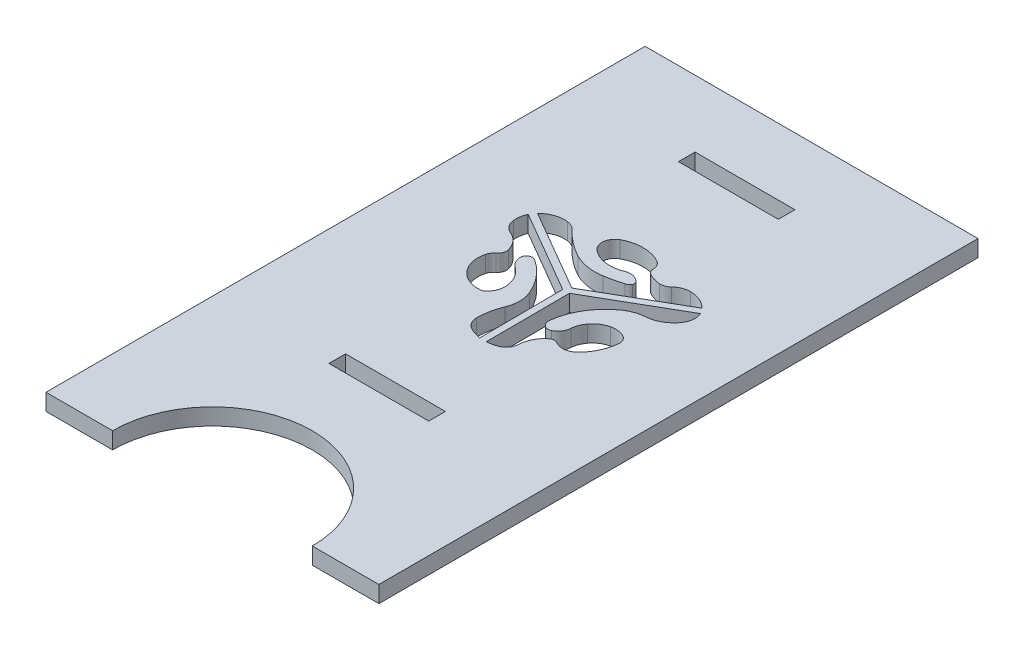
from build123d import *

# Parameters (mm, degrees)
CROQUIS1_W              = 30
CROQUIS1_H              = 5
SALIENTE_EXTRUIR1_DEPTH = 5
CORTAR_EXTRUIR2_DEPTH   = 5


with BuildPart() as part:
    # Croquis1 → Saliente-Extruir1 (new body)
    with BuildSketch(Plane(origin=(0, 0, 0), x_dir=(1, 0, 0), z_dir=(0, 1, 0))):
        with BuildLine():
            Line((365.516384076, -130.906361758), (385.516384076, -130.906361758))
            Line((385.516384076, -130.906361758), (385.516384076, 49.093638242))
            Line((385.516384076, 49.093638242), (285.516384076, 49.093638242))
            Line((285.516384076, 49.093638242), (285.516384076, -130.906361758))
            Line((285.516384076, -130.906361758), (305.516384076, -130.906361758))
            ThreePointArc((305.516384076, -130.906361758), (335.516384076, -100.906361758), (365.516384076, -130.906361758))
        make_face()
        with Locations((335.516384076, -78.406361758)):
            Rectangle(CROQUIS1_W, CROQUIS1_H, mode=Mode.SUBTRACT)
        with Locations((335.516384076, 26.593638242)):
            Rectangle(CROQUIS1_W, CROQUIS1_H, mode=Mode.SUBTRACT)
    extrude(amount=SALIENTE_EXTRUIR1_DEPTH)

    # Croquis4 → Cortar-Extruir2 (cut)
    with BuildSketch(Plane(origin=(0, 5, 0), x_dir=(1, 0, 0), z_dir=(0, 1, 0))):
        with BuildLine():
            Line((312.827016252, -10.543085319), (312.952539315, -10.417562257))
            ThreePointArc((312.952539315, -10.417562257), (315.921384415, -8.555517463), (319.404768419, -8.171736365))
            ThreePointArc((319.404768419, -8.171736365), (321.037597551, -8.664763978), (322.396722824, -9.695290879))
            ThreePointArc((322.396722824, -9.695290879), (325.901256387, -12.907936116), (329.89635788, -15.485145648))
            ThreePointArc((329.89635788, -15.485145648), (334.243629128, -16.954058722), (338.832361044, -16.957570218))
            ThreePointArc((338.832361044, -16.957570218), (341.586272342, -16.419290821), (344.301186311, -15.710055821))
            ThreePointArc((344.301186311, -15.710055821), (345.027414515, -15.330995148), (345.555892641, -14.705051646))
            ThreePointArc((345.555892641, -14.705051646), (345.673849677, -14.107559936), (345.420501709, -13.553732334))
            ThreePointArc((345.420501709, -13.553732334), (343.325322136, -12.341412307), (340.913612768, -12.549150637))
            ThreePointArc((340.913612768, -12.549150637), (336.109653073, -13.204137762), (331.599607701, -11.424663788))
            ThreePointArc((331.599607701, -11.424663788), (330.043567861, -8.095229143), (332.017732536, -4.995379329))
            ThreePointArc((332.017732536, -4.995379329), (337.562552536, -3.574896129), (343.107372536, -4.995379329))
            ThreePointArc((343.107372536, -4.995379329), (344.263600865, -6.114031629), (344.688538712, -7.665700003))
            ThreePointArc((344.688538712, -7.665700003), (344.952815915, -8.644717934), (345.673849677, -9.357759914))
            ThreePointArc((345.673849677, -9.357759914), (347.458418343, -10.130114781), (349.366838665, -10.503141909))
            ThreePointArc((349.366838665, -10.503141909), (350.837765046, -10.313837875), (352.09851706, -9.532835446))
            ThreePointArc((352.09851706, -9.532835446), (353.951641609, -8.329439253), (356.120624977, -7.907842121))
            ThreePointArc((356.120624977, -7.907842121), (359.412807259, -8.582685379), (362.173974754, -10.49836585))
            Line((362.173974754, -10.49836585), (337.378624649, -24.801731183))
            Line((337.378624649, -24.801731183), (312.827016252, -10.543085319))
        make_face()
        with BuildLine():
            Line((311.633322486, -12.162653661), (336.379986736, -26.534580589))
            Line((336.379986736, -26.534580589), (336.512961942, -51.576074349))
            ThreePointArc((336.512961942, -51.576074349), (334.710373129, -51.178572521), (333.009513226, -50.4613489))
            ThreePointArc((333.009513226, -50.4613489), (331.412509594, -48.942721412), (330.824303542, -46.818889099))
            ThreePointArc((330.824303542, -46.818889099), (331.18172949, -43.197043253), (332.240217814, -39.714928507))
            ThreePointArc((332.240217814, -39.714928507), (332.969491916, -36.055996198), (332.240217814, -32.397063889))
            ThreePointArc((332.240217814, -32.397063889), (329.037325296, -27.109724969), (324.405309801, -23.015960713))
            ThreePointArc((324.405309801, -23.015960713), (322.593859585, -22.949340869), (321.668354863, -24.50793995))
            ThreePointArc((321.668354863, -24.50793995), (322.127128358, -26.381137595), (323.399603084, -27.830327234))
            ThreePointArc((323.399603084, -27.830327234), (325.886976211, -30.537957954), (327.000125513, -34.042125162))
            ThreePointArc((327.000125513, -34.042125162), (326.849763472, -35.865660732), (326.09277439, -37.531451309))
            ThreePointArc((326.09277439, -37.531451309), (325.820047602, -37.914063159), (325.531792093, -38.285116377))
            ThreePointArc((325.531792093, -38.285116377), (324.943944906, -38.7736037), (324.213895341, -38.99990397))
            ThreePointArc((324.213895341, -38.99990397), (317.328202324, -36.270672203), (315.637577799, -29.059343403))
            ThreePointArc((315.637577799, -29.059343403), (316.127858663, -27.958614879), (316.953194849, -27.080663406))
            ThreePointArc((316.953194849, -27.080663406), (317.837674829, -25.859425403), (317.891839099, -24.352510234))
            ThreePointArc((317.891839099, -24.352510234), (316.376443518, -21.504218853), (313.75621254, -19.621779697))
            ThreePointArc((313.75621254, -19.621779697), (311.89260812, -18.168365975), (311.036174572, -15.965650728))
            ThreePointArc((311.036174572, -15.965650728), (311.088315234, -14.025457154), (311.633322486, -12.162653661))
        make_face()
        with BuildLine():
            Line((338.380006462, -26.532985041), (363.344461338, -12.132070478))
            ThreePointArc((363.344461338, -12.132070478), (363.815419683, -14.582826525), (363.048217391, -16.957570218))
            ThreePointArc((363.048217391, -16.957570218), (359.980820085, -19.945283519), (355.893171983, -21.220622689))
            ThreePointArc((355.893171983, -21.220622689), (353.179215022, -21.771723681), (350.705119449, -23.015960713))
            ThreePointArc((350.705119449, -23.015960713), (345.118749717, -28.895778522), (342.449120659, -36.554294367))
            ThreePointArc((342.449120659, -36.554294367), (342.702706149, -37.934513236), (343.701070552, -38.920707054))
            ThreePointArc((343.701070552, -38.920707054), (344.560786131, -39.128522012), (345.420501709, -38.920707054))
            ThreePointArc((345.420501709, -38.920707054), (347.028275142, -37.482581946), (347.727729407, -35.442017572))
            ThreePointArc((347.727729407, -35.442017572), (348.150830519, -33.528379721), (349.095861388, -31.81142281))
            ThreePointArc((349.095861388, -31.81142281), (350.95112018, -30.072210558), (353.28370342, -29.059343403))
            ThreePointArc((353.28370342, -29.059343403), (355.476764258, -28.944338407), (357.562269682, -29.632385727))
            ThreePointArc((357.562269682, -29.632385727), (358.589707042, -30.668364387), (358.894718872, -32.095195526))
            ThreePointArc((358.894718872, -32.095195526), (357.720721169, -36.663055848), (355.037323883, -40.54158618))
            ThreePointArc((355.037323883, -40.54158618), (352.326623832, -41.877791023), (349.366838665, -41.267045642))
            ThreePointArc((349.366838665, -41.267045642), (348.251306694, -41.000076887), (347.179326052, -41.408171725))
            ThreePointArc((347.179326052, -41.408171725), (344.964562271, -44.077758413), (344.065430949, -47.427897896))
            ThreePointArc((344.065430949, -47.427897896), (343.337713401, -49.537418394), (341.586272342, -50.920206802))
            ThreePointArc((341.586272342, -50.920206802), (340.077532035, -51.395535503), (338.513280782, -51.630807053))
            Line((338.513280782, -51.630807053), (338.380006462, -26.532985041))
        make_face()
    extrude(amount=-CORTAR_EXTRUIR2_DEPTH, mode=Mode.SUBTRACT)


solid = part.part
